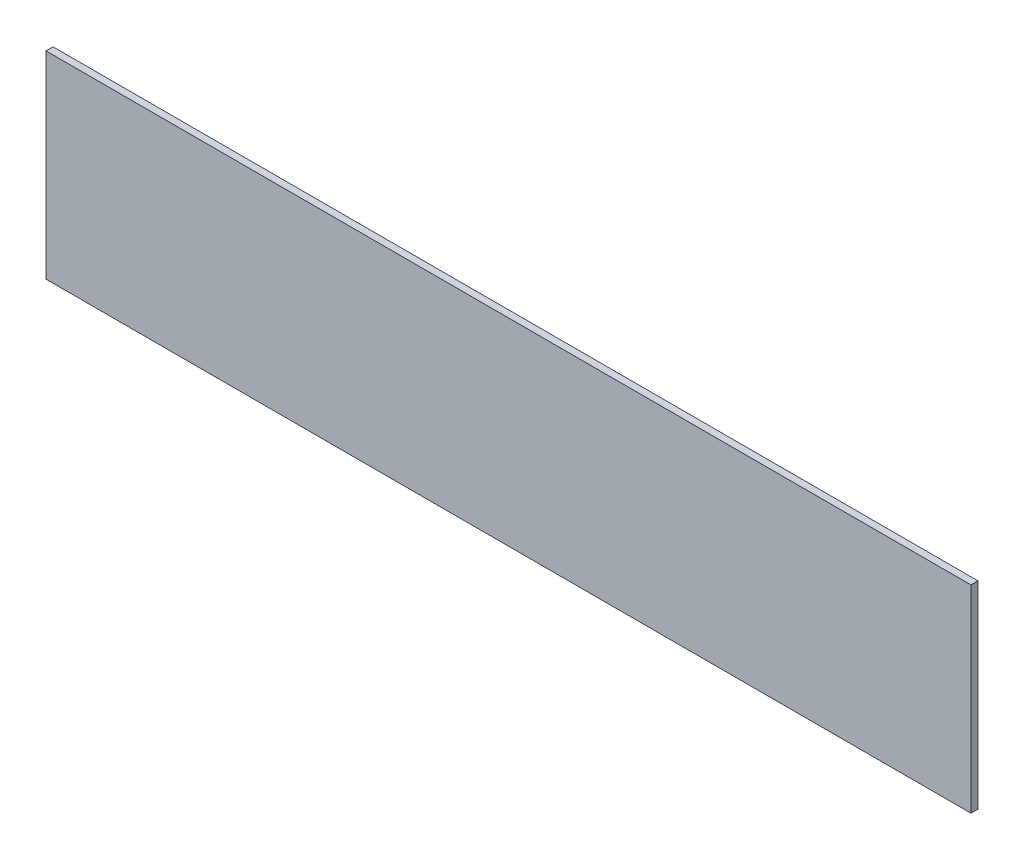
ISO-10303-21;
HEADER;
FILE_DESCRIPTION(('STEP AP214'),'2;1');
FILE_NAME('part.step','',(''),(''),'','','');
FILE_SCHEMA(('AUTOMOTIVE_DESIGN { 1 0 10303 214 1 1 1 1 }'));
ENDSEC;
DATA;
#1=APPLICATION_CONTEXT('core data for automotive mechanical design processes');
#2=APPLICATION_PROTOCOL_DEFINITION('international standard','automotive_design',2000,#1);
#3=PRODUCT_CONTEXT('',#1,'mechanical');
#4=PRODUCT('Part','Part','',(#3));
#5=PRODUCT_RELATED_PRODUCT_CATEGORY('part','',(#4));
#6=PRODUCT_DEFINITION_FORMATION('','',#4);
#7=PRODUCT_DEFINITION_CONTEXT('part definition',#1,'design');
#8=PRODUCT_DEFINITION('design','',#6,#7);
#9=PRODUCT_DEFINITION_SHAPE('','',#8);
#10=(LENGTH_UNIT() NAMED_UNIT(*) SI_UNIT(.MILLI.,.METRE.));
#11=(NAMED_UNIT(*) PLANE_ANGLE_UNIT() SI_UNIT($,.RADIAN.));
#12=(NAMED_UNIT(*) SI_UNIT($,.STERADIAN.) SOLID_ANGLE_UNIT());
#13=UNCERTAINTY_MEASURE_WITH_UNIT(LENGTH_MEASURE(1.E-05),#10,'distance_accuracy_value','');
#14=(GEOMETRIC_REPRESENTATION_CONTEXT(3) GLOBAL_UNCERTAINTY_ASSIGNED_CONTEXT((#13)) GLOBAL_UNIT_ASSIGNED_CONTEXT((#10,
#11,#12)) REPRESENTATION_CONTEXT('',''));
#15=CARTESIAN_POINT('',(0.,0.,0.));
#16=DIRECTION('',(0.,0.,1.));
#17=DIRECTION('',(1.,0.,0.));
#18=AXIS2_PLACEMENT_3D('',#15,#16,#17);
#19=CARTESIAN_POINT('',(207.9625,44.45,3.175));
#20=DIRECTION('',(-1.,0.,0.));
#21=DIRECTION('',(0.,0.,1.));
#22=AXIS2_PLACEMENT_3D('',#19,#20,#21);
#23=PLANE('',#22);
#24=DIRECTION('',(0.,1.,0.));
#25=VECTOR('',#24,1.);
#26=CARTESIAN_POINT('',(207.9625,44.45,0.));
#27=LINE('',#26,#25);
#28=CARTESIAN_POINT('',(207.9625,-44.45,0.));
#29=VERTEX_POINT('',#28);
#30=CARTESIAN_POINT('',(207.9625,44.45,0.));
#31=VERTEX_POINT('',#30);
#32=EDGE_CURVE('E95',#29,#31,#27,.T.);
#33=ORIENTED_EDGE('',*,*,#32,.T.);
#34=DIRECTION('',(0.,0.,-1.));
#35=VECTOR('',#34,1.);
#36=CARTESIAN_POINT('',(207.9625,44.45,3.175));
#37=LINE('',#36,#35);
#38=CARTESIAN_POINT('',(207.9625,44.45,3.175));
#39=VERTEX_POINT('',#38);
#40=EDGE_CURVE('E11',#39,#31,#37,.T.);
#41=ORIENTED_EDGE('',*,*,#40,.F.);
#42=DIRECTION('',(0.,1.,0.));
#43=VECTOR('',#42,1.);
#44=CARTESIAN_POINT('',(207.9625,44.45,3.175));
#45=LINE('',#44,#43);
#46=CARTESIAN_POINT('',(207.9625,-44.45,3.175));
#47=VERTEX_POINT('',#46);
#48=EDGE_CURVE('E83',#47,#39,#45,.T.);
#49=ORIENTED_EDGE('',*,*,#48,.F.);
#50=DIRECTION('',(0.,0.,-1.));
#51=VECTOR('',#50,1.);
#52=CARTESIAN_POINT('',(207.9625,-44.45,3.175));
#53=LINE('',#52,#51);
#54=EDGE_CURVE('E91',#47,#29,#53,.T.);
#55=ORIENTED_EDGE('',*,*,#54,.T.);
#56=EDGE_LOOP('',(#33,#41,#49,#55));
#57=FACE_BOUND('',#56,.T.);
#58=ADVANCED_FACE('F32',(#57),#23,.F.);
#59=CARTESIAN_POINT('',(-207.9625,44.45,3.175));
#60=DIRECTION('',(0.,-1.,0.));
#61=DIRECTION('',(0.,0.,-1.));
#62=AXIS2_PLACEMENT_3D('',#59,#60,#61);
#63=PLANE('',#62);
#64=DIRECTION('',(-1.,0.,0.));
#65=VECTOR('',#64,1.);
#66=CARTESIAN_POINT('',(-207.9625,44.45,0.));
#67=LINE('',#66,#65);
#68=CARTESIAN_POINT('',(-207.9625,44.45,0.));
#69=VERTEX_POINT('',#68);
#70=EDGE_CURVE('E87',#31,#69,#67,.T.);
#71=ORIENTED_EDGE('',*,*,#70,.T.);
#72=DIRECTION('',(0.,0.,-1.));
#73=VECTOR('',#72,1.);
#74=CARTESIAN_POINT('',(-207.9625,44.45,3.175));
#75=LINE('',#74,#73);
#76=CARTESIAN_POINT('',(-207.9625,44.45,3.175));
#77=VERTEX_POINT('',#76);
#78=EDGE_CURVE('E40',#77,#69,#75,.T.);
#79=ORIENTED_EDGE('',*,*,#78,.F.);
#80=DIRECTION('',(-1.,0.,0.));
#81=VECTOR('',#80,1.);
#82=CARTESIAN_POINT('',(-207.9625,44.45,3.175));
#83=LINE('',#82,#81);
#84=EDGE_CURVE('E78',#39,#77,#83,.T.);
#85=ORIENTED_EDGE('',*,*,#84,.F.);
#86=ORIENTED_EDGE('',*,*,#40,.T.);
#87=EDGE_LOOP('',(#71,#79,#85,#86));
#88=FACE_BOUND('',#87,.T.);
#89=ADVANCED_FACE('F86',(#88),#63,.F.);
#90=CARTESIAN_POINT('',(-207.9625,44.45,3.175));
#91=DIRECTION('',(1.,0.,0.));
#92=DIRECTION('',(0.,0.,-1.));
#93=AXIS2_PLACEMENT_3D('',#90,#91,#92);
#94=PLANE('',#93);
#95=DIRECTION('',(0.,-1.,0.));
#96=VECTOR('',#95,1.);
#97=CARTESIAN_POINT('',(-207.9625,44.45,0.));
#98=LINE('',#97,#96);
#99=CARTESIAN_POINT('',(-207.9625,-44.45,0.));
#100=VERTEX_POINT('',#99);
#101=EDGE_CURVE('E65',#69,#100,#98,.T.);
#102=ORIENTED_EDGE('',*,*,#101,.T.);
#103=DIRECTION('',(0.,0.,-1.));
#104=VECTOR('',#103,1.);
#105=CARTESIAN_POINT('',(-207.9625,-44.45,3.175));
#106=LINE('',#105,#104);
#107=CARTESIAN_POINT('',(-207.9625,-44.45,3.175));
#108=VERTEX_POINT('',#107);
#109=EDGE_CURVE('E88',#108,#100,#106,.T.);
#110=ORIENTED_EDGE('',*,*,#109,.F.);
#111=DIRECTION('',(0.,-1.,0.));
#112=VECTOR('',#111,1.);
#113=CARTESIAN_POINT('',(-207.9625,44.45,3.175));
#114=LINE('',#113,#112);
#115=EDGE_CURVE('E81',#77,#108,#114,.T.);
#116=ORIENTED_EDGE('',*,*,#115,.F.);
#117=ORIENTED_EDGE('',*,*,#78,.T.);
#118=EDGE_LOOP('',(#102,#110,#116,#117));
#119=FACE_BOUND('',#118,.T.);
#120=ADVANCED_FACE('F89',(#119),#94,.F.);
#121=CARTESIAN_POINT('',(-207.9625,-44.45,3.175));
#122=DIRECTION('',(0.,1.,0.));
#123=DIRECTION('',(0.,0.,1.));
#124=AXIS2_PLACEMENT_3D('',#121,#122,#123);
#125=PLANE('',#124);
#126=DIRECTION('',(1.,0.,0.));
#127=VECTOR('',#126,1.);
#128=CARTESIAN_POINT('',(-207.9625,-44.45,0.));
#129=LINE('',#128,#127);
#130=EDGE_CURVE('E71',#100,#29,#129,.T.);
#131=ORIENTED_EDGE('',*,*,#130,.T.);
#132=ORIENTED_EDGE('',*,*,#54,.F.);
#133=DIRECTION('',(1.,0.,0.));
#134=VECTOR('',#133,1.);
#135=CARTESIAN_POINT('',(-207.9625,-44.45,3.175));
#136=LINE('',#135,#134);
#137=EDGE_CURVE('E48',#108,#47,#136,.T.);
#138=ORIENTED_EDGE('',*,*,#137,.F.);
#139=ORIENTED_EDGE('',*,*,#109,.T.);
#140=EDGE_LOOP('',(#131,#132,#138,#139));
#141=FACE_BOUND('',#140,.T.);
#142=ADVANCED_FACE('F102',(#141),#125,.F.);
#143=CARTESIAN_POINT('',(0.,0.,3.175));
#144=DIRECTION('',(0.,0.,1.));
#145=DIRECTION('',(1.,0.,0.));
#146=AXIS2_PLACEMENT_3D('',#143,#144,#145);
#147=PLANE('',#146);
#148=ORIENTED_EDGE('',*,*,#48,.T.);
#149=ORIENTED_EDGE('',*,*,#84,.T.);
#150=ORIENTED_EDGE('',*,*,#115,.T.);
#151=ORIENTED_EDGE('',*,*,#137,.T.);
#152=EDGE_LOOP('',(#148,#149,#150,#151));
#153=FACE_BOUND('',#152,.T.);
#154=ADVANCED_FACE('F79',(#153),#147,.T.);
#155=CARTESIAN_POINT('',(0.,0.,0.));
#156=DIRECTION('',(0.,0.,1.));
#157=DIRECTION('',(1.,0.,0.));
#158=AXIS2_PLACEMENT_3D('',#155,#156,#157);
#159=PLANE('',#158);
#160=ORIENTED_EDGE('',*,*,#32,.F.);
#161=ORIENTED_EDGE('',*,*,#130,.F.);
#162=ORIENTED_EDGE('',*,*,#101,.F.);
#163=ORIENTED_EDGE('',*,*,#70,.F.);
#164=EDGE_LOOP('',(#160,#161,#162,#163));
#165=FACE_BOUND('',#164,.T.);
#166=ADVANCED_FACE('F105',(#165),#159,.F.);
#167=CLOSED_SHELL('',(#58,#89,#120,#142,#154,#166));
#168=MANIFOLD_SOLID_BREP('B2',#167);
#169=ADVANCED_BREP_SHAPE_REPRESENTATION('',(#18,#168),#14);
#170=SHAPE_DEFINITION_REPRESENTATION(#9,#169);
ENDSEC;
END-ISO-10303-21;
